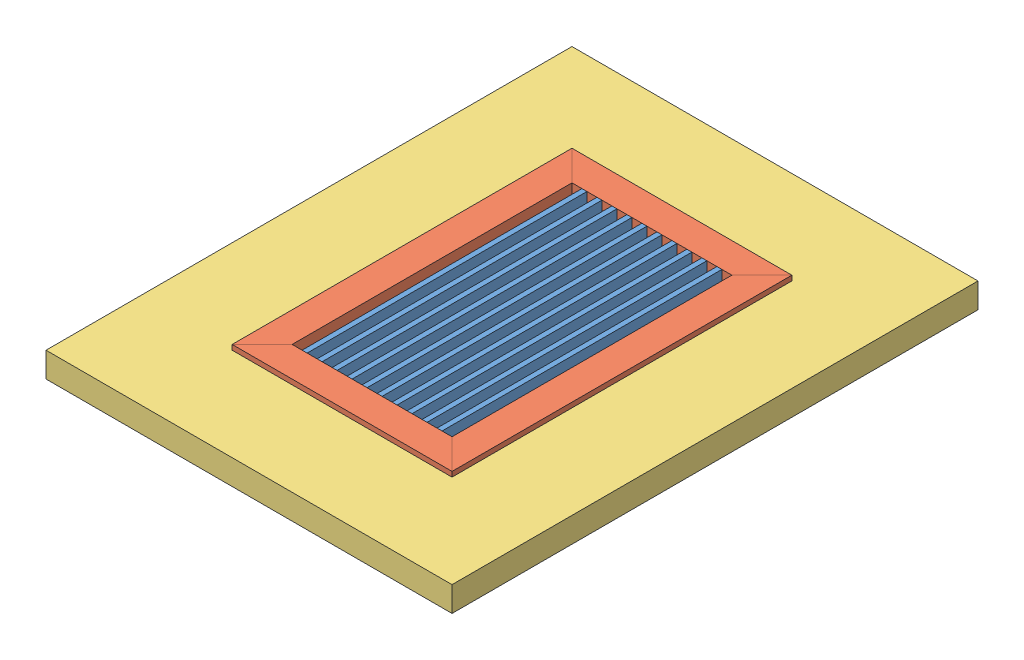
SolidWorks assembly 507.SLDASM, configuration Default (file format 11000). Lengths in mm.
Overall size (139.7 19.05 215.9).
3 component instances, 3 part files, 6 mates.
Components (placement in the parent):
- Standard AG10 Core-1: Standard AG10 Core.SLDPRT [Default] at origin size (101.6 19.05 177.8)
- Standard AG10 B Frame-1: Standard AG10 B Frame.SLDPRT [Default] at (-26.9875 9.525 -88.9) size (139.7 19.05 215.9)
- Countertop-1: Countertop.SLDPRT [Default] at (42.8625 -9.525 -88.9) x (0 0 -1) z (1 0 0) size (334.15 15.88 257.95) (hidden)
Mates (geometry in assembly coordinates):
- Coincident1: coincident: plane of Standard AG10 Core-1 through (-7.9375 0 0) normal (-1 0 0); plane of Standard AG10 B Frame-1 through (-7.9375 9.525 0) normal (1 0 0)
- Coincident2: coincident: plane of Standard AG10 Core-1 through (9.525 0 0) normal (0 0 1); plane of Standard AG10 B Frame-1 through (-26.9875 -134.6429 0) normal (0 0 -1)
- Coincident3: coincident: plane of Standard AG10 Core-1 through (49.2125 9.525 -177.8) normal (0 1 0); plane of Standard AG10 B Frame-1 through (-26.9875 9.525 0) normal (0 1 0)
- Coincident4: coincident: plane of Standard AG10 B Frame-1 through (-11.1125 6.35 0) normal (-1 0 0); plane of Countertop-1 through (-11.1125 6.35 -180.975) normal (1 0 0)
- Coincident5: coincident: plane of Standard AG10 B Frame-1 through (-11.1125 -117.5217 -180.975) normal (0 0 -1); plane of Countertop-1 through (96.8375 6.35 -180.975) normal (0 0 1)
- Coincident6: coincident: plane of Standard AG10 B Frame-1 through (-26.9875 6.35 0) normal (0 -1 0); plane of Countertop-1 through (42.8625 6.35 -88.9) normal (0 1 0)
